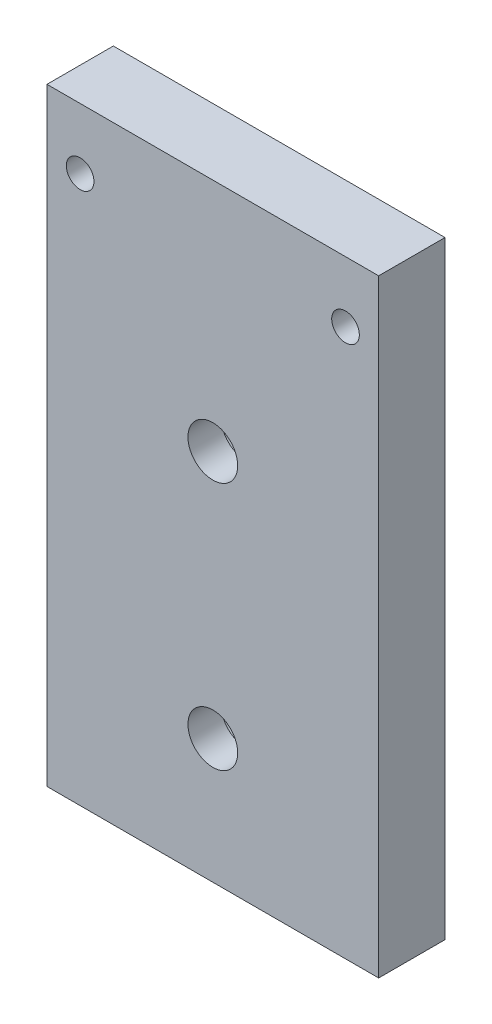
ISO-10303-21;
HEADER;
FILE_DESCRIPTION(('STEP AP214'),'2;1');
FILE_NAME('part.step','',(''),(''),'','','');
FILE_SCHEMA(('AUTOMOTIVE_DESIGN { 1 0 10303 214 1 1 1 1 }'));
ENDSEC;
DATA;
#1=APPLICATION_CONTEXT('core data for automotive mechanical design processes');
#2=APPLICATION_PROTOCOL_DEFINITION('international standard','automotive_design',2000,#1);
#3=PRODUCT_CONTEXT('',#1,'mechanical');
#4=PRODUCT('Part','Part','',(#3));
#5=PRODUCT_RELATED_PRODUCT_CATEGORY('part','',(#4));
#6=PRODUCT_DEFINITION_FORMATION('','',#4);
#7=PRODUCT_DEFINITION_CONTEXT('part definition',#1,'design');
#8=PRODUCT_DEFINITION('design','',#6,#7);
#9=PRODUCT_DEFINITION_SHAPE('','',#8);
#10=(LENGTH_UNIT() NAMED_UNIT(*) SI_UNIT(.MILLI.,.METRE.));
#11=(NAMED_UNIT(*) PLANE_ANGLE_UNIT() SI_UNIT($,.RADIAN.));
#12=(NAMED_UNIT(*) SI_UNIT($,.STERADIAN.) SOLID_ANGLE_UNIT());
#13=UNCERTAINTY_MEASURE_WITH_UNIT(LENGTH_MEASURE(1.E-05),#10,'distance_accuracy_value','');
#14=(GEOMETRIC_REPRESENTATION_CONTEXT(3) GLOBAL_UNCERTAINTY_ASSIGNED_CONTEXT((#13)) GLOBAL_UNIT_ASSIGNED_CONTEXT((#10,
#11,#12)) REPRESENTATION_CONTEXT('',''));
#15=CARTESIAN_POINT('',(0.,0.,0.));
#16=DIRECTION('',(0.,0.,1.));
#17=DIRECTION('',(1.,0.,0.));
#18=AXIS2_PLACEMENT_3D('',#15,#16,#17);
#19=CARTESIAN_POINT('',(0.,22.5,3.));
#20=DIRECTION('',(0.,0.,1.));
#21=DIRECTION('',(1.,0.,0.));
#22=AXIS2_PLACEMENT_3D('',#19,#20,#21);
#23=CYLINDRICAL_SURFACE('',#22,7.5);
#24=CARTESIAN_POINT('',(0.,22.5,6.));
#25=DIRECTION('',(0.,0.,1.));
#26=DIRECTION('',(1.,0.,0.));
#27=AXIS2_PLACEMENT_3D('',#24,#25,#26);
#28=CIRCLE('',#27,7.5);
#29=CARTESIAN_POINT('',(7.5,22.5,6.));
#30=VERTEX_POINT('',#29);
#31=EDGE_CURVE('E18',#30,#30,#28,.T.);
#32=ORIENTED_EDGE('',*,*,#31,.T.);
#33=EDGE_LOOP('',(#32));
#34=FACE_BOUND('',#33,.T.);
#35=CARTESIAN_POINT('',(0.,22.5,0.));
#36=DIRECTION('',(0.,0.,1.));
#37=DIRECTION('',(1.,0.,0.));
#38=AXIS2_PLACEMENT_3D('',#35,#36,#37);
#39=CIRCLE('',#38,7.5);
#40=CARTESIAN_POINT('',(7.5,22.5,0.));
#41=VERTEX_POINT('',#40);
#42=EDGE_CURVE('E105',#41,#41,#39,.F.);
#43=ORIENTED_EDGE('',*,*,#42,.T.);
#44=EDGE_LOOP('',(#43));
#45=FACE_BOUND('',#44,.T.);
#46=ADVANCED_FACE('F15',(#34,#45),#23,.F.);
#47=CARTESIAN_POINT('',(0.,-22.5,3.));
#48=DIRECTION('',(0.,0.,1.));
#49=DIRECTION('',(1.,0.,0.));
#50=AXIS2_PLACEMENT_3D('',#47,#48,#49);
#51=CYLINDRICAL_SURFACE('',#50,7.5);
#52=CARTESIAN_POINT('',(0.,-22.5,6.));
#53=DIRECTION('',(0.,0.,1.));
#54=DIRECTION('',(1.,0.,0.));
#55=AXIS2_PLACEMENT_3D('',#52,#53,#54);
#56=CIRCLE('',#55,7.5);
#57=CARTESIAN_POINT('',(7.5,-22.5,6.));
#58=VERTEX_POINT('',#57);
#59=EDGE_CURVE('E107',#58,#58,#56,.T.);
#60=ORIENTED_EDGE('',*,*,#59,.T.);
#61=EDGE_LOOP('',(#60));
#62=FACE_BOUND('',#61,.T.);
#63=CARTESIAN_POINT('',(0.,-22.5,0.));
#64=DIRECTION('',(0.,0.,1.));
#65=DIRECTION('',(1.,0.,0.));
#66=AXIS2_PLACEMENT_3D('',#63,#64,#65);
#67=CIRCLE('',#66,7.5);
#68=CARTESIAN_POINT('',(7.5,-22.5,0.));
#69=VERTEX_POINT('',#68);
#70=EDGE_CURVE('E67',#69,#69,#67,.F.);
#71=ORIENTED_EDGE('',*,*,#70,.T.);
#72=EDGE_LOOP('',(#71));
#73=FACE_BOUND('',#72,.T.);
#74=ADVANCED_FACE('F119',(#62,#73),#51,.F.);
#75=CARTESIAN_POINT('',(0.,22.5,6.));
#76=DIRECTION('',(0.,0.,1.));
#77=DIRECTION('',(1.,0.,0.));
#78=AXIS2_PLACEMENT_3D('',#75,#76,#77);
#79=PLANE('',#78);
#80=CARTESIAN_POINT('',(0.,22.5,5.99999999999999));
#81=DIRECTION('',(0.,0.,1.));
#82=DIRECTION('',(1.,0.,0.));
#83=AXIS2_PLACEMENT_3D('',#80,#81,#82);
#84=CIRCLE('',#83,4.5);
#85=CARTESIAN_POINT('',(4.5,22.5,5.99999999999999));
#86=VERTEX_POINT('',#85);
#87=EDGE_CURVE('E100',#86,#86,#84,.T.);
#88=ORIENTED_EDGE('',*,*,#87,.T.);
#89=EDGE_LOOP('',(#88));
#90=FACE_BOUND('',#89,.T.);
#91=ORIENTED_EDGE('',*,*,#31,.F.);
#92=EDGE_LOOP('',(#91));
#93=FACE_BOUND('',#92,.T.);
#94=ADVANCED_FACE('F116',(#90,#93),#79,.F.);
#95=CARTESIAN_POINT('',(0.,-22.5,6.));
#96=DIRECTION('',(0.,0.,1.));
#97=DIRECTION('',(1.,0.,0.));
#98=AXIS2_PLACEMENT_3D('',#95,#96,#97);
#99=PLANE('',#98);
#100=CARTESIAN_POINT('',(0.,-22.5,5.99999999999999));
#101=DIRECTION('',(0.,0.,1.));
#102=DIRECTION('',(1.,0.,0.));
#103=AXIS2_PLACEMENT_3D('',#100,#101,#102);
#104=CIRCLE('',#103,4.5);
#105=CARTESIAN_POINT('',(4.5,-22.5,5.99999999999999));
#106=VERTEX_POINT('',#105);
#107=EDGE_CURVE('E97',#106,#106,#104,.T.);
#108=ORIENTED_EDGE('',*,*,#107,.T.);
#109=EDGE_LOOP('',(#108));
#110=FACE_BOUND('',#109,.T.);
#111=ORIENTED_EDGE('',*,*,#59,.F.);
#112=EDGE_LOOP('',(#111));
#113=FACE_BOUND('',#112,.T.);
#114=ADVANCED_FACE('F118',(#110,#113),#99,.F.);
#115=CARTESIAN_POINT('',(0.,10.,0.));
#116=DIRECTION('',(0.,0.,1.));
#117=DIRECTION('',(1.,0.,0.));
#118=AXIS2_PLACEMENT_3D('',#115,#116,#117);
#119=PLANE('',#118);
#120=CARTESIAN_POINT('',(-24.,54.,0.));
#121=DIRECTION('',(0.,0.,1.));
#122=DIRECTION('',(1.,0.,0.));
#123=AXIS2_PLACEMENT_3D('',#120,#121,#122);
#124=CIRCLE('',#123,2.5);
#125=CARTESIAN_POINT('',(-21.5,54.,0.));
#126=VERTEX_POINT('',#125);
#127=EDGE_CURVE('E90',#126,#126,#124,.T.);
#128=ORIENTED_EDGE('',*,*,#127,.T.);
#129=EDGE_LOOP('',(#128));
#130=FACE_BOUND('',#129,.T.);
#131=CARTESIAN_POINT('',(24.,54.,0.));
#132=DIRECTION('',(0.,0.,1.));
#133=DIRECTION('',(1.,0.,0.));
#134=AXIS2_PLACEMENT_3D('',#131,#132,#133);
#135=CIRCLE('',#134,2.5);
#136=CARTESIAN_POINT('',(26.5,54.,0.));
#137=VERTEX_POINT('',#136);
#138=EDGE_CURVE('E94',#137,#137,#135,.T.);
#139=ORIENTED_EDGE('',*,*,#138,.T.);
#140=EDGE_LOOP('',(#139));
#141=FACE_BOUND('',#140,.T.);
#142=ORIENTED_EDGE('',*,*,#70,.F.);
#143=EDGE_LOOP('',(#142));
#144=FACE_BOUND('',#143,.T.);
#145=ORIENTED_EDGE('',*,*,#42,.F.);
#146=EDGE_LOOP('',(#145));
#147=FACE_BOUND('',#146,.T.);
#148=DIRECTION('',(0.,1.,0.));
#149=VECTOR('',#148,1.);
#150=CARTESIAN_POINT('',(-30.,-45.,0.));
#151=LINE('',#150,#149);
#152=CARTESIAN_POINT('',(-30.,65.,0.));
#153=VERTEX_POINT('',#152);
#154=CARTESIAN_POINT('',(-30.,-45.,0.));
#155=VERTEX_POINT('',#154);
#156=EDGE_CURVE('E58',#153,#155,#151,.F.);
#157=ORIENTED_EDGE('',*,*,#156,.F.);
#158=DIRECTION('',(1.,0.,0.));
#159=VECTOR('',#158,1.);
#160=CARTESIAN_POINT('',(-30.,65.,0.));
#161=LINE('',#160,#159);
#162=CARTESIAN_POINT('',(30.,65.,0.));
#163=VERTEX_POINT('',#162);
#164=EDGE_CURVE('E248',#163,#153,#161,.F.);
#165=ORIENTED_EDGE('',*,*,#164,.F.);
#166=DIRECTION('',(0.,1.,0.));
#167=VECTOR('',#166,1.);
#168=CARTESIAN_POINT('',(30.,65.,0.));
#169=LINE('',#168,#167);
#170=CARTESIAN_POINT('',(30.,-45.,0.));
#171=VERTEX_POINT('',#170);
#172=EDGE_CURVE('E70',#171,#163,#169,.T.);
#173=ORIENTED_EDGE('',*,*,#172,.F.);
#174=DIRECTION('',(1.,0.,0.));
#175=VECTOR('',#174,1.);
#176=CARTESIAN_POINT('',(30.,-45.,0.));
#177=LINE('',#176,#175);
#178=EDGE_CURVE('E53',#155,#171,#177,.T.);
#179=ORIENTED_EDGE('',*,*,#178,.F.);
#180=EDGE_LOOP('',(#157,#165,#173,#179));
#181=FACE_BOUND('',#180,.T.);
#182=ADVANCED_FACE('F69',(#130,#141,#144,#147,#181),#119,.F.);
#183=CARTESIAN_POINT('',(-30.,-45.,0.));
#184=DIRECTION('',(-1.,0.,0.));
#185=DIRECTION('',(0.,0.,1.));
#186=AXIS2_PLACEMENT_3D('',#183,#184,#185);
#187=PLANE('',#186);
#188=ORIENTED_EDGE('',*,*,#156,.T.);
#189=DIRECTION('',(0.,0.,-1.));
#190=VECTOR('',#189,1.);
#191=CARTESIAN_POINT('',(-30.,-45.,0.));
#192=LINE('',#191,#190);
#193=CARTESIAN_POINT('',(-30.,-45.,12.));
#194=VERTEX_POINT('',#193);
#195=EDGE_CURVE('E60',#194,#155,#192,.T.);
#196=ORIENTED_EDGE('',*,*,#195,.F.);
#197=DIRECTION('',(0.,1.,0.));
#198=VECTOR('',#197,1.);
#199=CARTESIAN_POINT('',(-30.,10.,12.));
#200=LINE('',#199,#198);
#201=CARTESIAN_POINT('',(-30.,65.,12.));
#202=VERTEX_POINT('',#201);
#203=EDGE_CURVE('E93',#202,#194,#200,.F.);
#204=ORIENTED_EDGE('',*,*,#203,.F.);
#205=DIRECTION('',(0.,0.,1.));
#206=VECTOR('',#205,1.);
#207=CARTESIAN_POINT('',(-30.,65.,0.));
#208=LINE('',#207,#206);
#209=EDGE_CURVE('E63',#153,#202,#208,.T.);
#210=ORIENTED_EDGE('',*,*,#209,.F.);
#211=EDGE_LOOP('',(#188,#196,#204,#210));
#212=FACE_BOUND('',#211,.T.);
#213=ADVANCED_FACE('F59',(#212),#187,.T.);
#214=CARTESIAN_POINT('',(30.,-45.,0.));
#215=DIRECTION('',(0.,-1.,0.));
#216=DIRECTION('',(0.,0.,-1.));
#217=AXIS2_PLACEMENT_3D('',#214,#215,#216);
#218=PLANE('',#217);
#219=ORIENTED_EDGE('',*,*,#178,.T.);
#220=DIRECTION('',(0.,0.,-1.));
#221=VECTOR('',#220,1.);
#222=CARTESIAN_POINT('',(30.,-45.,0.));
#223=LINE('',#222,#221);
#224=CARTESIAN_POINT('',(30.,-45.,12.));
#225=VERTEX_POINT('',#224);
#226=EDGE_CURVE('E72',#225,#171,#223,.T.);
#227=ORIENTED_EDGE('',*,*,#226,.F.);
#228=DIRECTION('',(1.,0.,0.));
#229=VECTOR('',#228,1.);
#230=CARTESIAN_POINT('',(0.,-45.,12.));
#231=LINE('',#230,#229);
#232=EDGE_CURVE('E76',#194,#225,#231,.T.);
#233=ORIENTED_EDGE('',*,*,#232,.F.);
#234=ORIENTED_EDGE('',*,*,#195,.T.);
#235=EDGE_LOOP('',(#219,#227,#233,#234));
#236=FACE_BOUND('',#235,.T.);
#237=ADVANCED_FACE('F74',(#236),#218,.T.);
#238=CARTESIAN_POINT('',(30.,65.,0.));
#239=DIRECTION('',(1.,0.,0.));
#240=DIRECTION('',(0.,0.,-1.));
#241=AXIS2_PLACEMENT_3D('',#238,#239,#240);
#242=PLANE('',#241);
#243=ORIENTED_EDGE('',*,*,#172,.T.);
#244=DIRECTION('',(0.,0.,1.));
#245=VECTOR('',#244,1.);
#246=CARTESIAN_POINT('',(30.,65.,0.));
#247=LINE('',#246,#245);
#248=CARTESIAN_POINT('',(30.,65.,12.));
#249=VERTEX_POINT('',#248);
#250=EDGE_CURVE('E33',#249,#163,#247,.F.);
#251=ORIENTED_EDGE('',*,*,#250,.F.);
#252=DIRECTION('',(0.,1.,0.));
#253=VECTOR('',#252,1.);
#254=CARTESIAN_POINT('',(30.,10.,12.));
#255=LINE('',#254,#253);
#256=EDGE_CURVE('E241',#225,#249,#255,.T.);
#257=ORIENTED_EDGE('',*,*,#256,.F.);
#258=ORIENTED_EDGE('',*,*,#226,.T.);
#259=EDGE_LOOP('',(#243,#251,#257,#258));
#260=FACE_BOUND('',#259,.T.);
#261=ADVANCED_FACE('F156',(#260),#242,.T.);
#262=CARTESIAN_POINT('',(-30.,65.,0.));
#263=DIRECTION('',(0.,1.,0.));
#264=DIRECTION('',(0.,0.,1.));
#265=AXIS2_PLACEMENT_3D('',#262,#263,#264);
#266=PLANE('',#265);
#267=ORIENTED_EDGE('',*,*,#164,.T.);
#268=ORIENTED_EDGE('',*,*,#209,.T.);
#269=DIRECTION('',(1.,0.,0.));
#270=VECTOR('',#269,1.);
#271=CARTESIAN_POINT('',(0.,65.,12.));
#272=LINE('',#271,#270);
#273=EDGE_CURVE('E89',#249,#202,#272,.F.);
#274=ORIENTED_EDGE('',*,*,#273,.F.);
#275=ORIENTED_EDGE('',*,*,#250,.T.);
#276=EDGE_LOOP('',(#267,#268,#274,#275));
#277=FACE_BOUND('',#276,.T.);
#278=ADVANCED_FACE('F152',(#277),#266,.T.);
#279=CARTESIAN_POINT('',(0.,22.5,125.872951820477));
#280=DIRECTION('',(0.,0.,1.));
#281=DIRECTION('',(1.,0.,0.));
#282=AXIS2_PLACEMENT_3D('',#279,#280,#281);
#283=CYLINDRICAL_SURFACE('',#282,4.5);
#284=ORIENTED_EDGE('',*,*,#87,.F.);
#285=EDGE_LOOP('',(#284));
#286=FACE_BOUND('',#285,.T.);
#287=CARTESIAN_POINT('',(0.,22.5,12.));
#288=DIRECTION('',(0.,0.,1.));
#289=DIRECTION('',(1.,0.,0.));
#290=AXIS2_PLACEMENT_3D('',#287,#288,#289);
#291=CIRCLE('',#290,4.5);
#292=CARTESIAN_POINT('',(4.5,22.5,12.));
#293=VERTEX_POINT('',#292);
#294=EDGE_CURVE('E86',#293,#293,#291,.F.);
#295=ORIENTED_EDGE('',*,*,#294,.F.);
#296=EDGE_LOOP('',(#295));
#297=FACE_BOUND('',#296,.T.);
#298=ADVANCED_FACE('F148',(#286,#297),#283,.F.);
#299=CARTESIAN_POINT('',(0.,-22.5,125.872951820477));
#300=DIRECTION('',(0.,0.,1.));
#301=DIRECTION('',(1.,0.,0.));
#302=AXIS2_PLACEMENT_3D('',#299,#300,#301);
#303=CYLINDRICAL_SURFACE('',#302,4.5);
#304=ORIENTED_EDGE('',*,*,#107,.F.);
#305=EDGE_LOOP('',(#304));
#306=FACE_BOUND('',#305,.T.);
#307=CARTESIAN_POINT('',(0.,-22.5,12.));
#308=DIRECTION('',(0.,0.,1.));
#309=DIRECTION('',(1.,0.,0.));
#310=AXIS2_PLACEMENT_3D('',#307,#308,#309);
#311=CIRCLE('',#310,4.5);
#312=CARTESIAN_POINT('',(4.5,-22.5,12.));
#313=VERTEX_POINT('',#312);
#314=EDGE_CURVE('E83',#313,#313,#311,.F.);
#315=ORIENTED_EDGE('',*,*,#314,.F.);
#316=EDGE_LOOP('',(#315));
#317=FACE_BOUND('',#316,.T.);
#318=ADVANCED_FACE('F144',(#306,#317),#303,.F.);
#319=CARTESIAN_POINT('',(24.,54.,0.));
#320=DIRECTION('',(0.,0.,1.));
#321=DIRECTION('',(1.,0.,0.));
#322=AXIS2_PLACEMENT_3D('',#319,#320,#321);
#323=CYLINDRICAL_SURFACE('',#322,2.5);
#324=ORIENTED_EDGE('',*,*,#138,.F.);
#325=EDGE_LOOP('',(#324));
#326=FACE_BOUND('',#325,.T.);
#327=CARTESIAN_POINT('',(24.,54.,12.));
#328=DIRECTION('',(0.,0.,1.));
#329=DIRECTION('',(1.,0.,0.));
#330=AXIS2_PLACEMENT_3D('',#327,#328,#329);
#331=CIRCLE('',#330,2.5);
#332=CARTESIAN_POINT('',(26.5,54.,12.));
#333=VERTEX_POINT('',#332);
#334=EDGE_CURVE('E24',#333,#333,#331,.F.);
#335=ORIENTED_EDGE('',*,*,#334,.F.);
#336=EDGE_LOOP('',(#335));
#337=FACE_BOUND('',#336,.T.);
#338=ADVANCED_FACE('F137',(#326,#337),#323,.F.);
#339=CARTESIAN_POINT('',(-24.,54.,0.));
#340=DIRECTION('',(0.,0.,1.));
#341=DIRECTION('',(1.,0.,0.));
#342=AXIS2_PLACEMENT_3D('',#339,#340,#341);
#343=CYLINDRICAL_SURFACE('',#342,2.5);
#344=ORIENTED_EDGE('',*,*,#127,.F.);
#345=EDGE_LOOP('',(#344));
#346=FACE_BOUND('',#345,.T.);
#347=CARTESIAN_POINT('',(-24.,54.,12.));
#348=DIRECTION('',(0.,0.,1.));
#349=DIRECTION('',(1.,0.,0.));
#350=AXIS2_PLACEMENT_3D('',#347,#348,#349);
#351=CIRCLE('',#350,2.5);
#352=CARTESIAN_POINT('',(-21.5,54.,12.));
#353=VERTEX_POINT('',#352);
#354=EDGE_CURVE('E10',#353,#353,#351,.F.);
#355=ORIENTED_EDGE('',*,*,#354,.F.);
#356=EDGE_LOOP('',(#355));
#357=FACE_BOUND('',#356,.T.);
#358=ADVANCED_FACE('F131',(#346,#357),#343,.F.);
#359=CARTESIAN_POINT('',(0.,10.,12.));
#360=DIRECTION('',(0.,0.,1.));
#361=DIRECTION('',(1.,0.,0.));
#362=AXIS2_PLACEMENT_3D('',#359,#360,#361);
#363=PLANE('',#362);
#364=ORIENTED_EDGE('',*,*,#354,.T.);
#365=EDGE_LOOP('',(#364));
#366=FACE_BOUND('',#365,.T.);
#367=ORIENTED_EDGE('',*,*,#334,.T.);
#368=EDGE_LOOP('',(#367));
#369=FACE_BOUND('',#368,.T.);
#370=ORIENTED_EDGE('',*,*,#314,.T.);
#371=EDGE_LOOP('',(#370));
#372=FACE_BOUND('',#371,.T.);
#373=ORIENTED_EDGE('',*,*,#294,.T.);
#374=EDGE_LOOP('',(#373));
#375=FACE_BOUND('',#374,.T.);
#376=ORIENTED_EDGE('',*,*,#256,.T.);
#377=ORIENTED_EDGE('',*,*,#273,.T.);
#378=ORIENTED_EDGE('',*,*,#203,.T.);
#379=ORIENTED_EDGE('',*,*,#232,.T.);
#380=EDGE_LOOP('',(#376,#377,#378,#379));
#381=FACE_BOUND('',#380,.T.);
#382=ADVANCED_FACE('F129',(#366,#369,#372,#375,#381),#363,.T.);
#383=CLOSED_SHELL('',(#46,#74,#94,#114,#182,#213,#237,#261,#278,#298,#318,#338,#358,#382));
#384=MANIFOLD_SOLID_BREP('B1',#383);
#385=ADVANCED_BREP_SHAPE_REPRESENTATION('',(#18,#384),#14);
#386=SHAPE_DEFINITION_REPRESENTATION(#9,#385);
ENDSEC;
END-ISO-10303-21;
